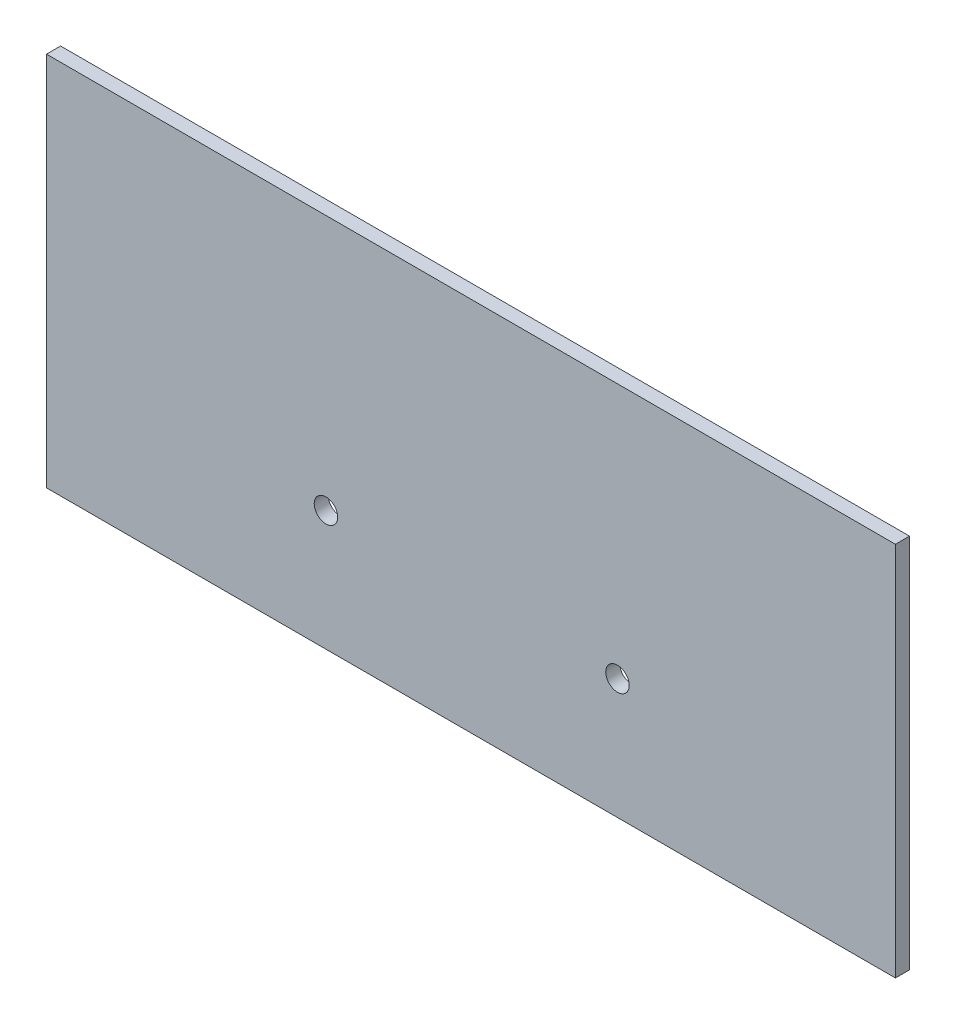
ISO-10303-21;
HEADER;
FILE_DESCRIPTION(('STEP AP214'),'2;1');
FILE_NAME('part.step','',(''),(''),'','','');
FILE_SCHEMA(('AUTOMOTIVE_DESIGN { 1 0 10303 214 1 1 1 1 }'));
ENDSEC;
DATA;
#1=APPLICATION_CONTEXT('core data for automotive mechanical design processes');
#2=APPLICATION_PROTOCOL_DEFINITION('international standard','automotive_design',2000,#1);
#3=PRODUCT_CONTEXT('',#1,'mechanical');
#4=PRODUCT('Part','Part','',(#3));
#5=PRODUCT_RELATED_PRODUCT_CATEGORY('part','',(#4));
#6=PRODUCT_DEFINITION_FORMATION('','',#4);
#7=PRODUCT_DEFINITION_CONTEXT('part definition',#1,'design');
#8=PRODUCT_DEFINITION('design','',#6,#7);
#9=PRODUCT_DEFINITION_SHAPE('','',#8);
#10=(LENGTH_UNIT() NAMED_UNIT(*) SI_UNIT(.MILLI.,.METRE.));
#11=(NAMED_UNIT(*) PLANE_ANGLE_UNIT() SI_UNIT($,.RADIAN.));
#12=(NAMED_UNIT(*) SI_UNIT($,.STERADIAN.) SOLID_ANGLE_UNIT());
#13=UNCERTAINTY_MEASURE_WITH_UNIT(LENGTH_MEASURE(1.E-05),#10,'distance_accuracy_value','');
#14=(GEOMETRIC_REPRESENTATION_CONTEXT(3) GLOBAL_UNCERTAINTY_ASSIGNED_CONTEXT((#13)) GLOBAL_UNIT_ASSIGNED_CONTEXT((#10,
#11,#12)) REPRESENTATION_CONTEXT('',''));
#15=CARTESIAN_POINT('',(0.,0.,0.));
#16=DIRECTION('',(0.,0.,1.));
#17=DIRECTION('',(1.,0.,0.));
#18=AXIS2_PLACEMENT_3D('',#15,#16,#17);
#19=CARTESIAN_POINT('',(0.,0.,-4.7625));
#20=DIRECTION('',(-1.,0.,0.));
#21=DIRECTION('',(0.,0.,1.));
#22=AXIS2_PLACEMENT_3D('',#19,#20,#21);
#23=PLANE('',#22);
#24=DIRECTION('',(0.,-1.,0.));
#25=VECTOR('',#24,1.);
#26=CARTESIAN_POINT('',(0.,0.,0.));
#27=LINE('',#26,#25);
#28=CARTESIAN_POINT('',(0.,127.,0.));
#29=VERTEX_POINT('',#28);
#30=CARTESIAN_POINT('',(0.,0.,0.));
#31=VERTEX_POINT('',#30);
#32=EDGE_CURVE('E95',#29,#31,#27,.T.);
#33=ORIENTED_EDGE('',*,*,#32,.F.);
#34=DIRECTION('',(0.,0.,1.));
#35=VECTOR('',#34,1.);
#36=CARTESIAN_POINT('',(0.,127.,-4.7625));
#37=LINE('',#36,#35);
#38=CARTESIAN_POINT('',(0.,127.,-4.7625));
#39=VERTEX_POINT('',#38);
#40=EDGE_CURVE('E11',#39,#29,#37,.T.);
#41=ORIENTED_EDGE('',*,*,#40,.F.);
#42=DIRECTION('',(0.,-1.,0.));
#43=VECTOR('',#42,1.);
#44=CARTESIAN_POINT('',(0.,0.,-4.7625));
#45=LINE('',#44,#43);
#46=CARTESIAN_POINT('',(0.,0.,-4.7625));
#47=VERTEX_POINT('',#46);
#48=EDGE_CURVE('E105',#39,#47,#45,.T.);
#49=ORIENTED_EDGE('',*,*,#48,.T.);
#50=DIRECTION('',(0.,0.,1.));
#51=VECTOR('',#50,1.);
#52=CARTESIAN_POINT('',(0.,0.,-4.7625));
#53=LINE('',#52,#51);
#54=EDGE_CURVE('E46',#47,#31,#53,.T.);
#55=ORIENTED_EDGE('',*,*,#54,.T.);
#56=EDGE_LOOP('',(#33,#41,#49,#55));
#57=FACE_BOUND('',#56,.T.);
#58=ADVANCED_FACE('F43',(#57),#23,.T.);
#59=CARTESIAN_POINT('',(287.02,0.,-4.7625));
#60=DIRECTION('',(1.,0.,0.));
#61=DIRECTION('',(0.,0.,-1.));
#62=AXIS2_PLACEMENT_3D('',#59,#60,#61);
#63=PLANE('',#62);
#64=DIRECTION('',(0.,1.,0.));
#65=VECTOR('',#64,1.);
#66=CARTESIAN_POINT('',(287.02,0.,0.));
#67=LINE('',#66,#65);
#68=CARTESIAN_POINT('',(287.02,0.,0.));
#69=VERTEX_POINT('',#68);
#70=CARTESIAN_POINT('',(287.02,127.,0.));
#71=VERTEX_POINT('',#70);
#72=EDGE_CURVE('E96',#69,#71,#67,.T.);
#73=ORIENTED_EDGE('',*,*,#72,.F.);
#74=DIRECTION('',(0.,0.,1.));
#75=VECTOR('',#74,1.);
#76=CARTESIAN_POINT('',(287.02,0.,-4.7625));
#77=LINE('',#76,#75);
#78=CARTESIAN_POINT('',(287.02,0.,-4.7625));
#79=VERTEX_POINT('',#78);
#80=EDGE_CURVE('E61',#79,#69,#77,.T.);
#81=ORIENTED_EDGE('',*,*,#80,.F.);
#82=DIRECTION('',(0.,1.,0.));
#83=VECTOR('',#82,1.);
#84=CARTESIAN_POINT('',(287.02,0.,-4.7625));
#85=LINE('',#84,#83);
#86=CARTESIAN_POINT('',(287.02,127.,-4.7625));
#87=VERTEX_POINT('',#86);
#88=EDGE_CURVE('E102',#79,#87,#85,.T.);
#89=ORIENTED_EDGE('',*,*,#88,.T.);
#90=DIRECTION('',(0.,0.,1.));
#91=VECTOR('',#90,1.);
#92=CARTESIAN_POINT('',(287.02,127.,-4.7625));
#93=LINE('',#92,#91);
#94=EDGE_CURVE('E52',#87,#71,#93,.T.);
#95=ORIENTED_EDGE('',*,*,#94,.T.);
#96=EDGE_LOOP('',(#73,#81,#89,#95));
#97=FACE_BOUND('',#96,.T.);
#98=ADVANCED_FACE('F144',(#97),#63,.T.);
#99=CARTESIAN_POINT('',(0.,0.,-4.7625));
#100=DIRECTION('',(0.,-1.,0.));
#101=DIRECTION('',(0.,0.,-1.));
#102=AXIS2_PLACEMENT_3D('',#99,#100,#101);
#103=PLANE('',#102);
#104=DIRECTION('',(1.,0.,0.));
#105=VECTOR('',#104,1.);
#106=CARTESIAN_POINT('',(0.,0.,0.));
#107=LINE('',#106,#105);
#108=EDGE_CURVE('E98',#31,#69,#107,.T.);
#109=ORIENTED_EDGE('',*,*,#108,.F.);
#110=ORIENTED_EDGE('',*,*,#54,.F.);
#111=DIRECTION('',(1.,0.,0.));
#112=VECTOR('',#111,1.);
#113=CARTESIAN_POINT('',(0.,0.,-4.7625));
#114=LINE('',#113,#112);
#115=EDGE_CURVE('E107',#47,#79,#114,.T.);
#116=ORIENTED_EDGE('',*,*,#115,.T.);
#117=ORIENTED_EDGE('',*,*,#80,.T.);
#118=EDGE_LOOP('',(#109,#110,#116,#117));
#119=FACE_BOUND('',#118,.T.);
#120=ADVANCED_FACE('F138',(#119),#103,.T.);
#121=CARTESIAN_POINT('',(0.,0.,-4.7625));
#122=DIRECTION('',(0.,0.,-1.));
#123=DIRECTION('',(-1.,0.,0.));
#124=AXIS2_PLACEMENT_3D('',#121,#122,#123);
#125=PLANE('',#124);
#126=CARTESIAN_POINT('',(94.488,40.64,-4.7625));
#127=DIRECTION('',(0.,0.,-1.));
#128=DIRECTION('',(-1.,0.,0.));
#129=AXIS2_PLACEMENT_3D('',#126,#127,#128);
#130=CIRCLE('',#129,3.96874999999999);
#131=CARTESIAN_POINT('',(90.51925,40.64,-4.7625));
#132=VERTEX_POINT('',#131);
#133=EDGE_CURVE('E120',#132,#132,#130,.T.);
#134=ORIENTED_EDGE('',*,*,#133,.F.);
#135=EDGE_LOOP('',(#134));
#136=FACE_BOUND('',#135,.T.);
#137=CARTESIAN_POINT('',(193.04,40.64,-4.7625));
#138=DIRECTION('',(0.,0.,-1.));
#139=DIRECTION('',(-1.,0.,0.));
#140=AXIS2_PLACEMENT_3D('',#137,#138,#139);
#141=CIRCLE('',#140,3.96874999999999);
#142=CARTESIAN_POINT('',(189.07125,40.64,-4.7625));
#143=VERTEX_POINT('',#142);
#144=EDGE_CURVE('E114',#143,#143,#141,.T.);
#145=ORIENTED_EDGE('',*,*,#144,.F.);
#146=EDGE_LOOP('',(#145));
#147=FACE_BOUND('',#146,.T.);
#148=DIRECTION('',(-1.,0.,0.));
#149=VECTOR('',#148,1.);
#150=CARTESIAN_POINT('',(287.02,127.,-4.7625));
#151=LINE('',#150,#149);
#152=EDGE_CURVE('E85',#87,#39,#151,.T.);
#153=ORIENTED_EDGE('',*,*,#152,.F.);
#154=ORIENTED_EDGE('',*,*,#88,.F.);
#155=ORIENTED_EDGE('',*,*,#115,.F.);
#156=ORIENTED_EDGE('',*,*,#48,.F.);
#157=EDGE_LOOP('',(#153,#154,#155,#156));
#158=FACE_BOUND('',#157,.T.);
#159=ADVANCED_FACE('F135',(#136,#147,#158),#125,.T.);
#160=CARTESIAN_POINT('',(0.,0.,0.));
#161=DIRECTION('',(0.,0.,-1.));
#162=DIRECTION('',(-1.,0.,0.));
#163=AXIS2_PLACEMENT_3D('',#160,#161,#162);
#164=PLANE('',#163);
#165=CARTESIAN_POINT('',(94.488,40.64,0.));
#166=DIRECTION('',(0.,0.,-1.));
#167=DIRECTION('',(-1.,0.,0.));
#168=AXIS2_PLACEMENT_3D('',#165,#166,#167);
#169=CIRCLE('',#168,3.96874999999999);
#170=CARTESIAN_POINT('',(90.51925,40.64,0.));
#171=VERTEX_POINT('',#170);
#172=EDGE_CURVE('E112',#171,#171,#169,.T.);
#173=ORIENTED_EDGE('',*,*,#172,.T.);
#174=EDGE_LOOP('',(#173));
#175=FACE_BOUND('',#174,.T.);
#176=CARTESIAN_POINT('',(193.04,40.64,0.));
#177=DIRECTION('',(0.,0.,-1.));
#178=DIRECTION('',(-1.,0.,0.));
#179=AXIS2_PLACEMENT_3D('',#176,#177,#178);
#180=CIRCLE('',#179,3.96874999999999);
#181=CARTESIAN_POINT('',(189.07125,40.64,0.));
#182=VERTEX_POINT('',#181);
#183=EDGE_CURVE('E117',#182,#182,#180,.T.);
#184=ORIENTED_EDGE('',*,*,#183,.T.);
#185=EDGE_LOOP('',(#184));
#186=FACE_BOUND('',#185,.T.);
#187=ORIENTED_EDGE('',*,*,#72,.T.);
#188=DIRECTION('',(-1.,0.,0.));
#189=VECTOR('',#188,1.);
#190=CARTESIAN_POINT('',(287.02,127.,0.));
#191=LINE('',#190,#189);
#192=EDGE_CURVE('E81',#71,#29,#191,.T.);
#193=ORIENTED_EDGE('',*,*,#192,.T.);
#194=ORIENTED_EDGE('',*,*,#32,.T.);
#195=ORIENTED_EDGE('',*,*,#108,.T.);
#196=EDGE_LOOP('',(#187,#193,#194,#195));
#197=FACE_BOUND('',#196,.T.);
#198=ADVANCED_FACE('F93',(#175,#186,#197),#164,.F.);
#199=CARTESIAN_POINT('',(287.02,127.,0.));
#200=DIRECTION('',(0.,-1.,0.));
#201=DIRECTION('',(0.,0.,-1.));
#202=AXIS2_PLACEMENT_3D('',#199,#200,#201);
#203=PLANE('',#202);
#204=ORIENTED_EDGE('',*,*,#152,.T.);
#205=ORIENTED_EDGE('',*,*,#40,.T.);
#206=ORIENTED_EDGE('',*,*,#192,.F.);
#207=ORIENTED_EDGE('',*,*,#94,.F.);
#208=EDGE_LOOP('',(#204,#205,#206,#207));
#209=FACE_BOUND('',#208,.T.);
#210=ADVANCED_FACE('F79',(#209),#203,.F.);
#211=CARTESIAN_POINT('',(193.04,40.64,0.));
#212=DIRECTION('',(0.,0.,-1.));
#213=DIRECTION('',(-1.,0.,0.));
#214=AXIS2_PLACEMENT_3D('',#211,#212,#213);
#215=CYLINDRICAL_SURFACE('',#214,3.96874999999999);
#216=CARTESIAN_POINT('',(189.07125,40.64,0.));
#217=CARTESIAN_POINT('',(189.07125,40.64,-0.049609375));
#218=CARTESIAN_POINT('',(189.07125,40.64,-0.09921875));
#219=CARTESIAN_POINT('',(189.07125,40.64,-0.1984375));
#220=CARTESIAN_POINT('',(189.07125,40.64,-0.248046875));
#221=CARTESIAN_POINT('',(189.07125,40.64,-0.347265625));
#222=CARTESIAN_POINT('',(189.07125,40.64,-0.396875));
#223=CARTESIAN_POINT('',(189.07125,40.64,-0.49609375));
#224=CARTESIAN_POINT('',(189.07125,40.64,-0.545703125));
#225=CARTESIAN_POINT('',(189.07125,40.64,-0.644921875));
#226=CARTESIAN_POINT('',(189.07125,40.64,-0.69453125));
#227=CARTESIAN_POINT('',(189.07125,40.64,-0.79375));
#228=CARTESIAN_POINT('',(189.07125,40.64,-0.843359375));
#229=CARTESIAN_POINT('',(189.07125,40.64,-0.942578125));
#230=CARTESIAN_POINT('',(189.07125,40.64,-0.9921875));
#231=CARTESIAN_POINT('',(189.07125,40.64,-1.09140625));
#232=CARTESIAN_POINT('',(189.07125,40.64,-1.141015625));
#233=CARTESIAN_POINT('',(189.07125,40.64,-1.240234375));
#234=CARTESIAN_POINT('',(189.07125,40.64,-1.28984375));
#235=CARTESIAN_POINT('',(189.07125,40.64,-1.3890625));
#236=CARTESIAN_POINT('',(189.07125,40.64,-1.438671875));
#237=CARTESIAN_POINT('',(189.07125,40.64,-1.537890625));
#238=CARTESIAN_POINT('',(189.07125,40.64,-1.5875));
#239=CARTESIAN_POINT('',(189.07125,40.64,-1.68671875));
#240=CARTESIAN_POINT('',(189.07125,40.64,-1.736328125));
#241=CARTESIAN_POINT('',(189.07125,40.64,-1.835546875));
#242=CARTESIAN_POINT('',(189.07125,40.64,-1.88515625));
#243=CARTESIAN_POINT('',(189.07125,40.64,-1.984375));
#244=CARTESIAN_POINT('',(189.07125,40.64,-2.033984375));
#245=CARTESIAN_POINT('',(189.07125,40.64,-2.133203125));
#246=CARTESIAN_POINT('',(189.07125,40.64,-2.1828125));
#247=CARTESIAN_POINT('',(189.07125,40.64,-2.28203125));
#248=CARTESIAN_POINT('',(189.07125,40.64,-2.331640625));
#249=CARTESIAN_POINT('',(189.07125,40.64,-2.430859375));
#250=CARTESIAN_POINT('',(189.07125,40.64,-2.48046875));
#251=CARTESIAN_POINT('',(189.07125,40.64,-2.5796875));
#252=CARTESIAN_POINT('',(189.07125,40.64,-2.629296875));
#253=CARTESIAN_POINT('',(189.07125,40.64,-2.728515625));
#254=CARTESIAN_POINT('',(189.07125,40.64,-2.778125));
#255=CARTESIAN_POINT('',(189.07125,40.64,-2.87734375));
#256=CARTESIAN_POINT('',(189.07125,40.64,-2.926953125));
#257=CARTESIAN_POINT('',(189.07125,40.64,-3.026171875));
#258=CARTESIAN_POINT('',(189.07125,40.64,-3.07578125));
#259=CARTESIAN_POINT('',(189.07125,40.64,-3.175));
#260=CARTESIAN_POINT('',(189.07125,40.64,-3.224609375));
#261=CARTESIAN_POINT('',(189.07125,40.64,-3.323828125));
#262=CARTESIAN_POINT('',(189.07125,40.64,-3.3734375));
#263=CARTESIAN_POINT('',(189.07125,40.64,-3.47265625));
#264=CARTESIAN_POINT('',(189.07125,40.64,-3.522265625));
#265=CARTESIAN_POINT('',(189.07125,40.64,-3.621484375));
#266=CARTESIAN_POINT('',(189.07125,40.64,-3.67109375));
#267=CARTESIAN_POINT('',(189.07125,40.64,-3.7703125));
#268=CARTESIAN_POINT('',(189.07125,40.64,-3.819921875));
#269=CARTESIAN_POINT('',(189.07125,40.64,-3.919140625));
#270=CARTESIAN_POINT('',(189.07125,40.64,-3.96875));
#271=CARTESIAN_POINT('',(189.07125,40.64,-4.06796875));
#272=CARTESIAN_POINT('',(189.07125,40.64,-4.117578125));
#273=CARTESIAN_POINT('',(189.07125,40.64,-4.216796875));
#274=CARTESIAN_POINT('',(189.07125,40.64,-4.26640625));
#275=CARTESIAN_POINT('',(189.07125,40.64,-4.365625));
#276=CARTESIAN_POINT('',(189.07125,40.64,-4.415234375));
#277=CARTESIAN_POINT('',(189.07125,40.64,-4.514453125));
#278=CARTESIAN_POINT('',(189.07125,40.64,-4.5640625));
#279=CARTESIAN_POINT('',(189.07125,40.64,-4.66328125));
#280=CARTESIAN_POINT('',(189.07125,40.64,-4.712890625));
#281=CARTESIAN_POINT('',(189.07125,40.64,-4.7625));
#282=B_SPLINE_CURVE_WITH_KNOTS('',3,(#216,#217,#218,#219,#220,#221,#222,#223,#224,#225,#226,
#227,#228,#229,#230,#231,#232,#233,#234,#235,#236,#237,#238,#239,#240,#241,#242,#243,#244,#245,
#246,#247,#248,#249,#250,#251,#252,#253,#254,#255,#256,#257,#258,#259,#260,#261,#262,#263,#264,
#265,#266,#267,#268,#269,#270,#271,#272,#273,#274,#275,#276,#277,#278,#279,#280,#281),
.UNSPECIFIED.,.F.,.F.,(4,2,2,2,2,2,2,2,2,2,2,2,2,2,2,2,2,2,2,2,2,2,2,2,2,2,2,2,2,2,2,2,4),(0.,
0.148828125,0.29765625,0.446484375,0.5953125,0.744140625,0.89296875,1.041796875,1.190625,
1.339453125,1.48828125,1.637109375,1.7859375,1.934765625,2.08359375,2.232421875,2.38125,
2.530078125,2.67890625,2.827734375,2.9765625,3.125390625,3.27421875,3.423046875,3.571875,
3.720703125,3.86953125,4.018359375,4.1671875,4.316015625,4.46484375,4.613671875,4.7625),.UNSPECIFIED.);
#283=EDGE_CURVE('BSEAM131',#182,#143,#282,.T.);
#284=ORIENTED_EDGE('',*,*,#183,.F.);
#285=ORIENTED_EDGE('',*,*,#144,.T.);
#286=ORIENTED_EDGE('',*,*,#283,.T.);
#287=ORIENTED_EDGE('',*,*,#283,.F.);
#288=EDGE_LOOP('',(#284,#286,#285,#287));
#289=FACE_BOUND('',#288,.T.);
#290=ADVANCED_FACE('F131',(#289),#215,.F.);
#291=CARTESIAN_POINT('',(94.488,40.64,0.));
#292=DIRECTION('',(0.,0.,-1.));
#293=DIRECTION('',(-1.,0.,0.));
#294=AXIS2_PLACEMENT_3D('',#291,#292,#293);
#295=CYLINDRICAL_SURFACE('',#294,3.96874999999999);
#296=CARTESIAN_POINT('',(90.51925,40.64,0.));
#297=CARTESIAN_POINT('',(90.51925,40.64,-0.049609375));
#298=CARTESIAN_POINT('',(90.51925,40.64,-0.09921875));
#299=CARTESIAN_POINT('',(90.51925,40.64,-0.1984375));
#300=CARTESIAN_POINT('',(90.51925,40.64,-0.248046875));
#301=CARTESIAN_POINT('',(90.51925,40.64,-0.347265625));
#302=CARTESIAN_POINT('',(90.51925,40.64,-0.396875));
#303=CARTESIAN_POINT('',(90.51925,40.64,-0.49609375));
#304=CARTESIAN_POINT('',(90.51925,40.64,-0.545703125));
#305=CARTESIAN_POINT('',(90.51925,40.64,-0.644921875));
#306=CARTESIAN_POINT('',(90.51925,40.64,-0.69453125));
#307=CARTESIAN_POINT('',(90.51925,40.64,-0.79375));
#308=CARTESIAN_POINT('',(90.51925,40.64,-0.843359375));
#309=CARTESIAN_POINT('',(90.51925,40.64,-0.942578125));
#310=CARTESIAN_POINT('',(90.51925,40.64,-0.9921875));
#311=CARTESIAN_POINT('',(90.51925,40.64,-1.09140625));
#312=CARTESIAN_POINT('',(90.51925,40.64,-1.141015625));
#313=CARTESIAN_POINT('',(90.51925,40.64,-1.240234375));
#314=CARTESIAN_POINT('',(90.51925,40.64,-1.28984375));
#315=CARTESIAN_POINT('',(90.51925,40.64,-1.3890625));
#316=CARTESIAN_POINT('',(90.51925,40.64,-1.438671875));
#317=CARTESIAN_POINT('',(90.51925,40.64,-1.537890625));
#318=CARTESIAN_POINT('',(90.51925,40.64,-1.5875));
#319=CARTESIAN_POINT('',(90.51925,40.64,-1.68671875));
#320=CARTESIAN_POINT('',(90.51925,40.64,-1.736328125));
#321=CARTESIAN_POINT('',(90.51925,40.64,-1.835546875));
#322=CARTESIAN_POINT('',(90.51925,40.64,-1.88515625));
#323=CARTESIAN_POINT('',(90.51925,40.64,-1.984375));
#324=CARTESIAN_POINT('',(90.51925,40.64,-2.033984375));
#325=CARTESIAN_POINT('',(90.51925,40.64,-2.133203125));
#326=CARTESIAN_POINT('',(90.51925,40.64,-2.1828125));
#327=CARTESIAN_POINT('',(90.51925,40.64,-2.28203125));
#328=CARTESIAN_POINT('',(90.51925,40.64,-2.331640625));
#329=CARTESIAN_POINT('',(90.51925,40.64,-2.430859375));
#330=CARTESIAN_POINT('',(90.51925,40.64,-2.48046875));
#331=CARTESIAN_POINT('',(90.51925,40.64,-2.5796875));
#332=CARTESIAN_POINT('',(90.51925,40.64,-2.629296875));
#333=CARTESIAN_POINT('',(90.51925,40.64,-2.728515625));
#334=CARTESIAN_POINT('',(90.51925,40.64,-2.778125));
#335=CARTESIAN_POINT('',(90.51925,40.64,-2.87734375));
#336=CARTESIAN_POINT('',(90.51925,40.64,-2.926953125));
#337=CARTESIAN_POINT('',(90.51925,40.64,-3.026171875));
#338=CARTESIAN_POINT('',(90.51925,40.64,-3.07578125));
#339=CARTESIAN_POINT('',(90.51925,40.64,-3.175));
#340=CARTESIAN_POINT('',(90.51925,40.64,-3.224609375));
#341=CARTESIAN_POINT('',(90.51925,40.64,-3.323828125));
#342=CARTESIAN_POINT('',(90.51925,40.64,-3.3734375));
#343=CARTESIAN_POINT('',(90.51925,40.64,-3.47265625));
#344=CARTESIAN_POINT('',(90.51925,40.64,-3.522265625));
#345=CARTESIAN_POINT('',(90.51925,40.64,-3.621484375));
#346=CARTESIAN_POINT('',(90.51925,40.64,-3.67109375));
#347=CARTESIAN_POINT('',(90.51925,40.64,-3.7703125));
#348=CARTESIAN_POINT('',(90.51925,40.64,-3.819921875));
#349=CARTESIAN_POINT('',(90.51925,40.64,-3.919140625));
#350=CARTESIAN_POINT('',(90.51925,40.64,-3.96875));
#351=CARTESIAN_POINT('',(90.51925,40.64,-4.06796875));
#352=CARTESIAN_POINT('',(90.51925,40.64,-4.117578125));
#353=CARTESIAN_POINT('',(90.51925,40.64,-4.216796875));
#354=CARTESIAN_POINT('',(90.51925,40.64,-4.26640625));
#355=CARTESIAN_POINT('',(90.51925,40.64,-4.365625));
#356=CARTESIAN_POINT('',(90.51925,40.64,-4.415234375));
#357=CARTESIAN_POINT('',(90.51925,40.64,-4.514453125));
#358=CARTESIAN_POINT('',(90.51925,40.64,-4.5640625));
#359=CARTESIAN_POINT('',(90.51925,40.64,-4.66328125));
#360=CARTESIAN_POINT('',(90.51925,40.64,-4.712890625));
#361=CARTESIAN_POINT('',(90.51925,40.64,-4.7625));
#362=B_SPLINE_CURVE_WITH_KNOTS('',3,(#296,#297,#298,#299,#300,#301,#302,#303,#304,#305,#306,
#307,#308,#309,#310,#311,#312,#313,#314,#315,#316,#317,#318,#319,#320,#321,#322,#323,#324,#325,
#326,#327,#328,#329,#330,#331,#332,#333,#334,#335,#336,#337,#338,#339,#340,#341,#342,#343,#344,
#345,#346,#347,#348,#349,#350,#351,#352,#353,#354,#355,#356,#357,#358,#359,#360,#361),
.UNSPECIFIED.,.F.,.F.,(4,2,2,2,2,2,2,2,2,2,2,2,2,2,2,2,2,2,2,2,2,2,2,2,2,2,2,2,2,2,2,2,4),(0.,
0.148828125,0.29765625,0.446484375,0.5953125,0.744140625,0.89296875,1.041796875,1.190625,
1.339453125,1.48828125,1.637109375,1.7859375,1.934765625,2.08359375,2.232421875,2.38125,
2.530078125,2.67890625,2.827734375,2.9765625,3.125390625,3.27421875,3.423046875,3.571875,
3.720703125,3.86953125,4.018359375,4.1671875,4.316015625,4.46484375,4.613671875,4.7625),.UNSPECIFIED.);
#363=EDGE_CURVE('BSEAM128',#171,#132,#362,.T.);
#364=ORIENTED_EDGE('',*,*,#172,.F.);
#365=ORIENTED_EDGE('',*,*,#133,.T.);
#366=ORIENTED_EDGE('',*,*,#363,.T.);
#367=ORIENTED_EDGE('',*,*,#363,.F.);
#368=EDGE_LOOP('',(#364,#366,#365,#367));
#369=FACE_BOUND('',#368,.T.);
#370=ADVANCED_FACE('F128',(#369),#295,.F.);
#371=CLOSED_SHELL('',(#58,#98,#120,#159,#198,#210,#290,#370));
#372=MANIFOLD_SOLID_BREP('B2',#371);
#373=ADVANCED_BREP_SHAPE_REPRESENTATION('',(#18,#372),#14);
#374=SHAPE_DEFINITION_REPRESENTATION(#9,#373);
ENDSEC;
END-ISO-10303-21;
